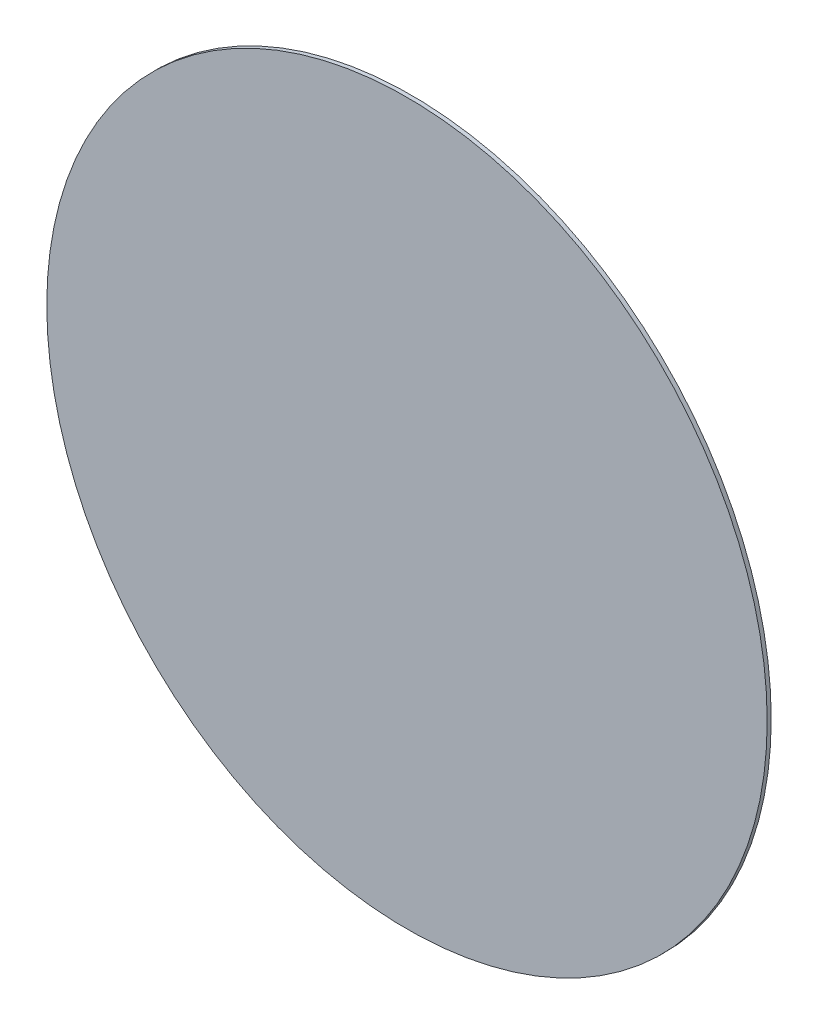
ISO-10303-21;
HEADER;
FILE_DESCRIPTION(('STEP AP214'),'2;1');
FILE_NAME('part.step','',(''),(''),'','','');
FILE_SCHEMA(('AUTOMOTIVE_DESIGN { 1 0 10303 214 1 1 1 1 }'));
ENDSEC;
DATA;
#1=APPLICATION_CONTEXT('core data for automotive mechanical design processes');
#2=APPLICATION_PROTOCOL_DEFINITION('international standard','automotive_design',2000,#1);
#3=PRODUCT_CONTEXT('',#1,'mechanical');
#4=PRODUCT('Part','Part','',(#3));
#5=PRODUCT_RELATED_PRODUCT_CATEGORY('part','',(#4));
#6=PRODUCT_DEFINITION_FORMATION('','',#4);
#7=PRODUCT_DEFINITION_CONTEXT('part definition',#1,'design');
#8=PRODUCT_DEFINITION('design','',#6,#7);
#9=PRODUCT_DEFINITION_SHAPE('','',#8);
#10=(LENGTH_UNIT() NAMED_UNIT(*) SI_UNIT(.MILLI.,.METRE.));
#11=(NAMED_UNIT(*) PLANE_ANGLE_UNIT() SI_UNIT($,.RADIAN.));
#12=(NAMED_UNIT(*) SI_UNIT($,.STERADIAN.) SOLID_ANGLE_UNIT());
#13=UNCERTAINTY_MEASURE_WITH_UNIT(LENGTH_MEASURE(1.E-05),#10,'distance_accuracy_value','');
#14=(GEOMETRIC_REPRESENTATION_CONTEXT(3) GLOBAL_UNCERTAINTY_ASSIGNED_CONTEXT((#13)) GLOBAL_UNIT_ASSIGNED_CONTEXT((#10,
#11,#12)) REPRESENTATION_CONTEXT('',''));
#15=CARTESIAN_POINT('',(0.,0.,0.));
#16=DIRECTION('',(0.,0.,1.));
#17=DIRECTION('',(1.,0.,0.));
#18=AXIS2_PLACEMENT_3D('',#15,#16,#17);
#19=CARTESIAN_POINT('',(0.,0.,0.14));
#20=DIRECTION('',(0.,0.,-1.));
#21=DIRECTION('',(-1.,0.,0.));
#22=AXIS2_PLACEMENT_3D('',#19,#20,#21);
#23=CYLINDRICAL_SURFACE('',#22,12.5);
#24=CARTESIAN_POINT('',(0.,0.,0.14));
#25=DIRECTION('',(0.,0.,1.));
#26=DIRECTION('',(1.,0.,0.));
#27=AXIS2_PLACEMENT_3D('',#24,#25,#26);
#28=CIRCLE('',#27,12.5);
#29=CARTESIAN_POINT('',(12.5,0.,0.14));
#30=VERTEX_POINT('',#29);
#31=EDGE_CURVE('E10',#30,#30,#28,.T.);
#32=ORIENTED_EDGE('',*,*,#31,.F.);
#33=EDGE_LOOP('',(#32));
#34=FACE_BOUND('',#33,.T.);
#35=CARTESIAN_POINT('',(0.,0.,0.));
#36=DIRECTION('',(0.,0.,1.));
#37=DIRECTION('',(1.,0.,0.));
#38=AXIS2_PLACEMENT_3D('',#35,#36,#37);
#39=CIRCLE('',#38,12.5);
#40=CARTESIAN_POINT('',(12.5,0.,0.));
#41=VERTEX_POINT('',#40);
#42=EDGE_CURVE('E33',#41,#41,#39,.T.);
#43=ORIENTED_EDGE('',*,*,#42,.T.);
#44=EDGE_LOOP('',(#43));
#45=FACE_BOUND('',#44,.T.);
#46=ADVANCED_FACE('F27',(#34,#45),#23,.T.);
#47=CARTESIAN_POINT('',(0.,0.,0.14));
#48=DIRECTION('',(0.,0.,1.));
#49=DIRECTION('',(1.,0.,0.));
#50=AXIS2_PLACEMENT_3D('',#47,#48,#49);
#51=PLANE('',#50);
#52=ORIENTED_EDGE('',*,*,#31,.T.);
#53=EDGE_LOOP('',(#52));
#54=FACE_BOUND('',#53,.T.);
#55=ADVANCED_FACE('F42',(#54),#51,.T.);
#56=CARTESIAN_POINT('',(0.,0.,0.));
#57=DIRECTION('',(0.,0.,1.));
#58=DIRECTION('',(1.,0.,0.));
#59=AXIS2_PLACEMENT_3D('',#56,#57,#58);
#60=PLANE('',#59);
#61=ORIENTED_EDGE('',*,*,#42,.F.);
#62=EDGE_LOOP('',(#61));
#63=FACE_BOUND('',#62,.T.);
#64=ADVANCED_FACE('F40',(#63),#60,.F.);
#65=CLOSED_SHELL('',(#46,#55,#64));
#66=MANIFOLD_SOLID_BREP('B2',#65);
#67=ADVANCED_BREP_SHAPE_REPRESENTATION('',(#18,#66),#14);
#68=SHAPE_DEFINITION_REPRESENTATION(#9,#67);
ENDSEC;
END-ISO-10303-21;
